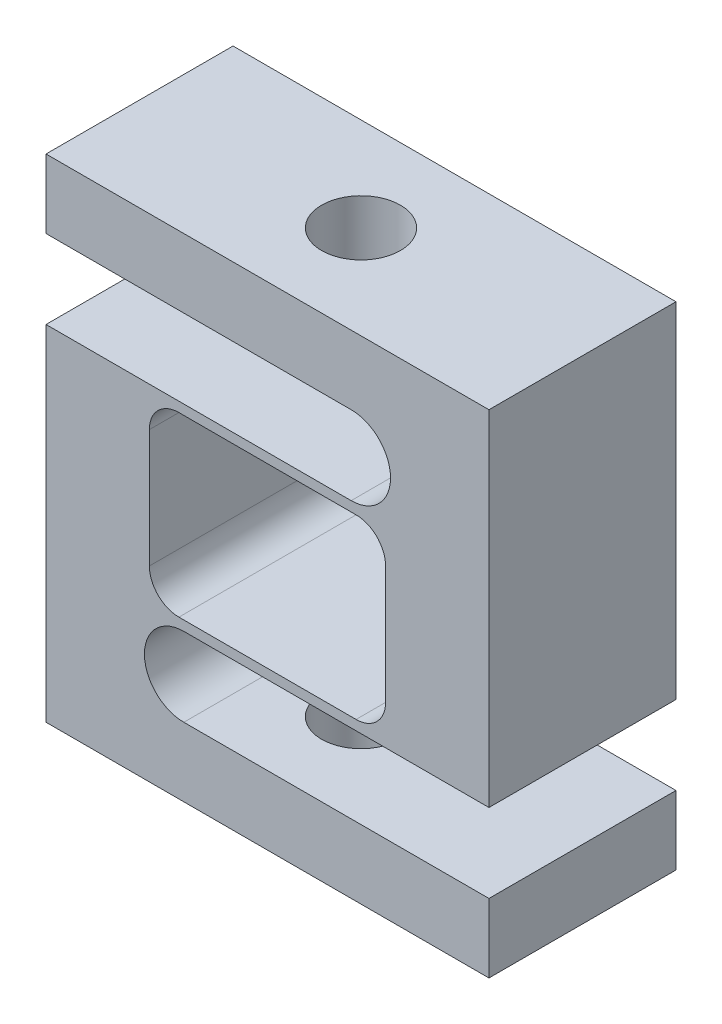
from build123d import *

# Parameters (mm, degrees)
ESQUISSE1_W             = 24
ESQUISSE1_H             = 18
BOSS_EXTRU_1_DEPTH      = 9.5
ENL_V_MAT_EXTRU_2_REACH = 57.646
ESQUISSE2_R             = 4
ENL_V_MAT_EXTRU_3_REACH = 57.646
ESQUISSE4_R             = 4
CONG_1_R                = 3


with BuildPart() as part:
    # Esquisse1 → Boss.-Extru.1 (new, symmetric)
    with BuildSketch(Plane.XY):
        with BuildLine():
            Line((-22.5, 18), (8.5, 18))
            ThreePointArc((8.5, 18), (12.5, 14), (8.5, 10))
            Line((8.5, 10), (-22.5, 10))
            Line((-22.5, 10), (-22.5, -25))
            Line((-22.5, -25), (22.5, -25))
            Line((22.5, -25), (22.5, -18))
            Line((22.5, -18), (-8.5, -18))
            ThreePointArc((-8.5, -18), (-12.5, -14), (-8.5, -10))
            Line((-8.5, -10), (22.5, -10))
            Line((22.5, -10), (22.5, 25))
            Line((22.5, 25), (-22.5, 25))
            Line((-22.5, 25), (-22.5, 18))
        make_face()
        Rectangle(ESQUISSE1_W, ESQUISSE1_H, mode=Mode.SUBTRACT)
    extrude(amount=BOSS_EXTRU_1_DEPTH, both=True)

    # Esquisse2 → Enl_v. mat.-Extru.2 (cut, up to next)
    with BuildSketch(Plane(origin=(0, 25, 0), x_dir=(1, 0, 0), z_dir=(0, 1, 0)), mode=Mode.PRIVATE) as enl_v_mat_extru_2_sk1:
        with Locations(Location((0, 0, 0), (0, 0, 180))):
            Circle(ESQUISSE2_R)
    enl_v_mat_extru_2_tool1 = extrude(enl_v_mat_extru_2_sk1.sketch, amount=-ENL_V_MAT_EXTRU_2_REACH, mode=Mode.PRIVATE) & part.part
    add(enl_v_mat_extru_2_tool1.solids().sort_by_distance((0, 25, 0))[0], mode=Mode.SUBTRACT)

    # Esquisse4 → Enl_v. mat.-Extru.3 (cut, up to next)
    with BuildSketch(Plane.XZ.offset(25), mode=Mode.PRIVATE) as enl_v_mat_extru_3_sk1:
        with Locations(Location((0, 0, 0), (0, 0, 180))):
            Circle(ESQUISSE4_R)
    enl_v_mat_extru_3_tool1 = extrude(enl_v_mat_extru_3_sk1.sketch, amount=-ENL_V_MAT_EXTRU_3_REACH, mode=Mode.PRIVATE) & part.part
    add(enl_v_mat_extru_3_tool1.solids().sort_by_distance((0, -25, 0))[0], mode=Mode.SUBTRACT)

    # Cong_1
    cong_1_edges = [part.edges().sort_by_distance(p)[0] for p in [
        (-12, 9, 0),
        (-12, -9, 0),
        (12, -9, 0),
        (12, 9, 0),
    ]]
    fillet(cong_1_edges, radius=CONG_1_R)


solid = part.part
